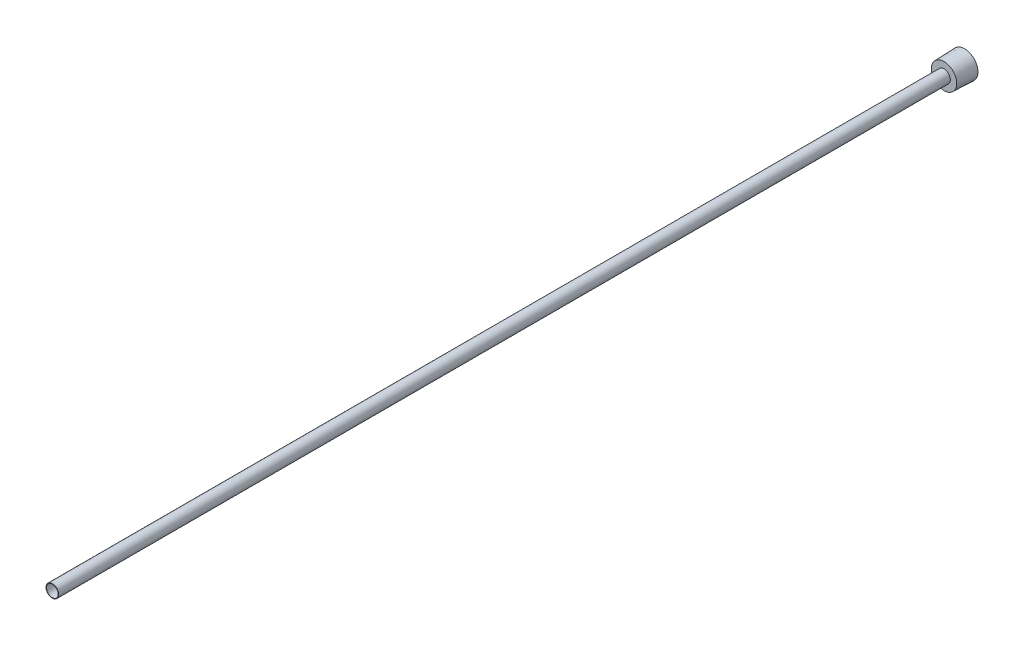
from build123d import *

# Parameters (mm, degrees)
SKETCH2_R          = 2.921
CUT_EXTRUDE1_DEPTH = 458.29871103
CUT_EXTRUDE2_DEPTH = 6.35


with BuildPart() as part:
    # Sketch1 → Revolve1 (revolve)
    with BuildSketch(Plane(origin=(0, 0, 0), x_dir=(0, 0, -1), z_dir=(1, 0, 0)), mode=Mode.PRIVATE) as revolve1_sk:
        Polygon((0, 0), (-457.2, 0), (-457.2, 3.175), (-10.3124, 3.175), (-10.3124, 6.342143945), (0, 6.7183), align=None)
    revolve(revolve1_sk.sketch.rotate(Axis((0, 0, 331.124179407), (0, 0, -1)), 90), axis=Axis((0, 0, 331.124179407), (0, 0, -1)))

    # Sketch2 → Cut-Extrude1 (cut, through all)
    with BuildSketch(Plane.XY.offset(457.2)):
        Circle(SKETCH2_R)
    extrude(amount=-CUT_EXTRUDE1_DEPTH, mode=Mode.SUBTRACT)

    # Sketch3 → Cut-Extrude2 (cut)
    with BuildSketch(Plane(origin=(0, 0, 0), x_dir=(-1, 0, 0), z_dir=(0, 0, -1))):
        Polygon((-3.175, -1.833087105), (0, -3.666174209), (3.175, -1.833087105), (3.175, 1.833087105), (0, 3.666174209), (-3.175, 1.833087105), align=None)
    extrude(amount=-CUT_EXTRUDE2_DEPTH, mode=Mode.SUBTRACT)


solid = part.part
